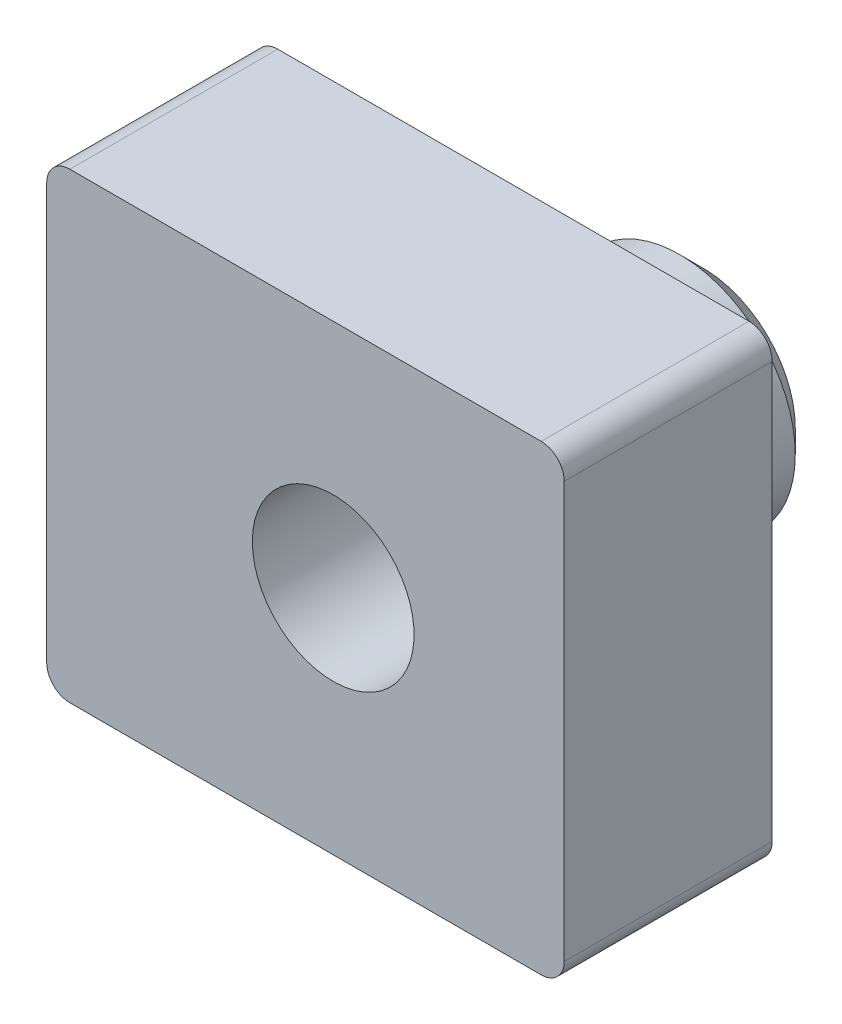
from build123d import *

# Parameters (mm, degrees)
SKICA2_R                 = 2.5
Z_KLAD_PROTA_EN_DEPTH    = 3
P_ID_N_PROTA_EN_1_DEPTH  = 0.5
P_ID_N_PROTA_EN_2_DEPTH  = 4.5
ZKOSEN_1_SIZE            = 0.5
SKICA5_R                 = 1.75
ODEBR_N_PROTA_EN_1_DEPTH = 18.720045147


with BuildPart() as part:
    # Skica2 → Z_klad-Prota_en (new body)
    with BuildSketch(Plane.XY):
        with Locations((10, 0)):
            Circle(SKICA2_R)
    extrude(amount=-Z_KLAD_PROTA_EN_DEPTH)

    # Skica3 → P_id_n_-Prota_en_1 (add)
    with BuildSketch(Plane.XY):
        with BuildLine():
            Line((8.115689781, -3.5), (11.884310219, -3.5))
            ThreePointArc((11.884310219, -3.5), (13.975, 0), (11.884310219, 3.5))
            Line((11.884310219, 3.5), (8.115689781, 3.5))
            ThreePointArc((8.115689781, 3.5), (6.025, 0), (8.115689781, -3.5))
        make_face()
    extrude(amount=P_ID_N_PROTA_EN_1_DEPTH)

    # Skica4 → P_id_n_-Prota_en_2 (add)
    with BuildSketch(Plane.XY.offset(0.5)):
        with BuildLine():
            Line((3.8, -4.5), (3.8, 4.5))
            ThreePointArc((3.8, 4.5), (3.946446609, 4.853553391), (4.3, 5))
            Line((4.3, 5), (14.5, 5))
            ThreePointArc((14.5, 5), (14.853553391, 4.853553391), (15, 4.5))
            Line((15, 4.5), (15, -4.5))
            ThreePointArc((15, -4.5), (14.853553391, -4.853553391), (14.5, -5))
            Line((14.5, -5), (4.3, -5))
            ThreePointArc((4.3, -5), (3.946446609, -4.853553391), (3.8, -4.5))
        make_face()
    extrude(amount=P_ID_N_PROTA_EN_2_DEPTH)

    # Zkosen_1
    zkosen_1_edges = [part.edges().sort_by_distance(p)[0] for p in [
        (7.5, 0, -3),
    ]]
    chamfer(zkosen_1_edges, length=ZKOSEN_1_SIZE)

    # Skica5 → Odebr_n_-Prota_en_1 (cut, through all)
    with BuildSketch(Plane(origin=(0, 0, -3), x_dir=(-1, 0, 0), z_dir=(0, 0, -1))):
        with Locations((-10, 0)):
            Circle(SKICA5_R)
    extrude(amount=-ODEBR_N_PROTA_EN_1_DEPTH, mode=Mode.SUBTRACT)


solid = part.part
